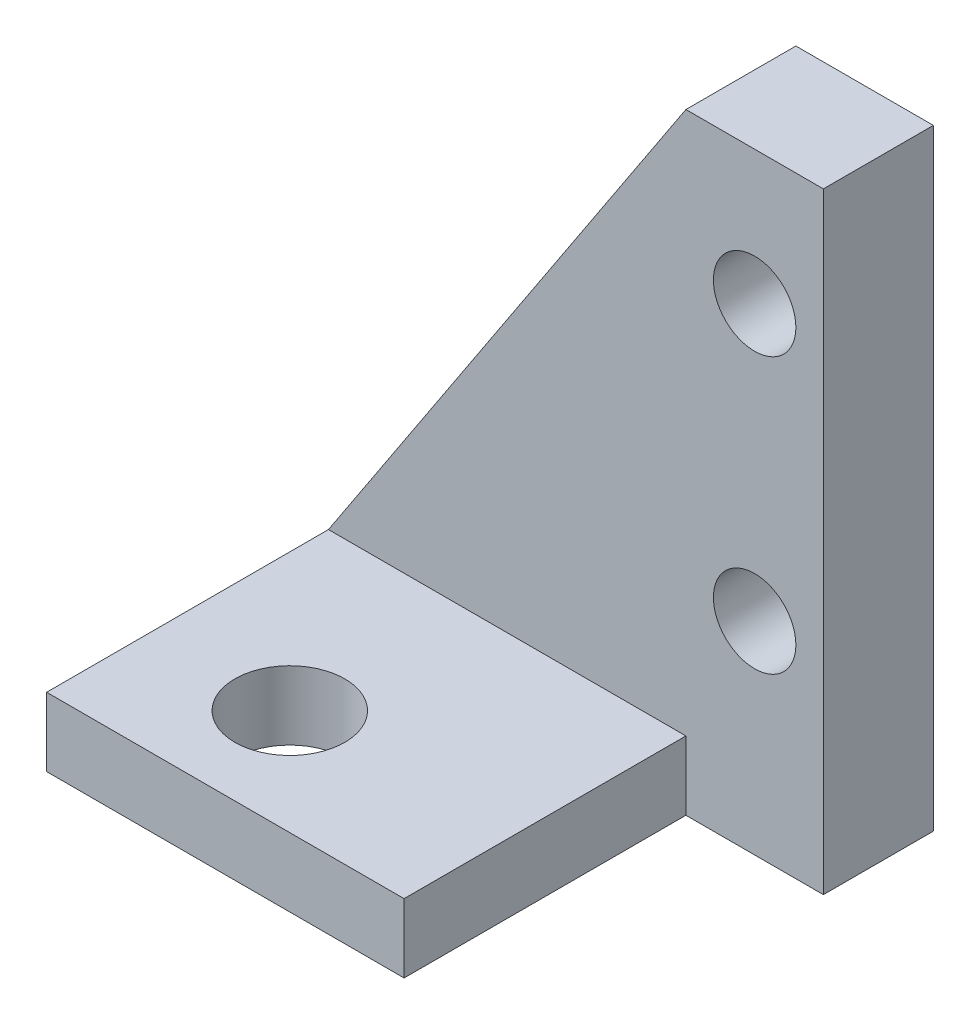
from build123d import *

# Parameters (mm, degrees)
SKETCH1_R            = 1.998719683
BOSS_EXTRUDE1_DEPTH  = 2.5
SKETCH5_W            = 10
SKETCH5_H            = 2.5
BOSS_EXTRUDE3_DEPTH  = 7.13
SKETCH6_W            = 10
SKETCH6_H            = 1.256651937
BOSS_EXTRUDE4_DEPTH  = 2.5
SKETCH8_W            = 5
SKETCH8_H            = 4
BOSS_EXTRUDE5_DEPTH  = 2.5
SKETCH9_W            = 5
SKETCH9_H            = 4
BOSS_EXTRUDE6_DEPTH  = 19.73
SKETCH12_R           = 1.5
CUT_EXTRUDE3_DEPTH   = 22
SKETCH13_W           = 3
SKETCH13_H           = 14.249346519
BOSS_EXTRUDE9_DEPTH  = 2.5
BOSS_EXTRUDE11_START = -2.5
SKETCH16_R           = 1.998719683
BOSS_EXTRUDE11_DEPTH = 2.5
SKETCH14_R           = 2
CUT_EXTRUDE5_DEPTH   = 2.5
BOSS_EXTRUDE12_DEPTH = 4


with BuildPart() as part:
    # Sketch1 → Boss-Extrude1 (new body)
    with BuildSketch(Plane(origin=(0, 0, 0), x_dir=(1, 0, 0), z_dir=(0, 1, 0))):
        Polygon((0, 4.586322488), (0, 0), (10, 0), (10, 5.862694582), (5, 5.862694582), (0, 5.862694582), align=None)
        with Locations(Location((5, 2.587602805, 0), (0, 0, 270))):
            Circle(SKETCH1_R, mode=Mode.SUBTRACT)
    extrude(amount=BOSS_EXTRUDE1_DEPTH)

    # Sketch5 → Boss-Extrude3 (add)
    with BuildSketch(Plane(origin=(0, 0, -5.862694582), x_dir=(-1, 0, 0), z_dir=(0, 0, -1))):
        with Locations((-5, 1.25)):
            Rectangle(SKETCH5_W, SKETCH5_H)
    extrude(amount=BOSS_EXTRUDE3_DEPTH)

    # Sketch6 → Boss-Extrude4 (add)
    with BuildSketch(Plane(origin=(0, 2.5, 0), x_dir=(1, 0, 0), z_dir=(0, 1, 0))):
        with Locations((5, -0.628325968)):
            Rectangle(SKETCH6_W, SKETCH6_H)
    extrude(amount=-BOSS_EXTRUDE4_DEPTH)

    # Sketch8 → Boss-Extrude5 (add)
    with BuildSketch(Plane(origin=(0, 2.5, 0), x_dir=(1, 0, 0), z_dir=(0, 1, 0))):
        with Locations((12.5, 10.992694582)):
            Rectangle(SKETCH8_W, SKETCH8_H)
    extrude(amount=-BOSS_EXTRUDE5_DEPTH)

    # Sketch9 → Boss-Extrude6 (add)
    with BuildSketch(Plane(origin=(0, 2.5, 0), x_dir=(-1, 0, 0), z_dir=(0, 1, 0))):
        with Locations((-12.5, -10.992694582)):
            Rectangle(SKETCH9_W, SKETCH9_H)
    extrude(amount=BOSS_EXTRUDE6_DEPTH)

    # Sketch12 → Cut-Extrude3 (cut)
    with BuildSketch(Plane.XY):
        with Locations((12.5, 17.365)):
            Circle(SKETCH12_R)
        with Locations((12.5, 7.365)):
            Circle(SKETCH12_R)
    extrude(amount=-CUT_EXTRUDE3_DEPTH, mode=Mode.SUBTRACT)

    # Sketch13 → Boss-Extrude9 (add)
    with BuildSketch(Plane(origin=(0, 2.5, 0), x_dir=(1, 0, 0), z_dir=(0, 1, 0))):
        with Locations((-1.5, 5.868021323)):
            Rectangle(SKETCH13_W, SKETCH13_H)
    extrude(amount=-BOSS_EXTRUDE9_DEPTH)

    # Sketch16 → Boss-Extrude11 (add)
    with BuildSketch(Plane(origin=(0, 2.5, 0), x_dir=(1, 0, 0), z_dir=(0, 1, 0)).offset(BOSS_EXTRUDE11_START)):
        with Locations((5, 2.587602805)):
            Circle(SKETCH16_R)
    extrude(amount=BOSS_EXTRUDE11_DEPTH)

    # Sketch14 → Cut-Extrude5 (cut)
    with BuildSketch(Plane(origin=(0, 2.5, 0), x_dir=(-1, 0, 0), z_dir=(0, 1, 0))):
        with Locations(Location((-2, -2.587602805, 0), (0, 0, 90))):
            Circle(SKETCH14_R)
    extrude(amount=-CUT_EXTRUDE5_DEPTH, mode=Mode.SUBTRACT)

    # Sketch15 → Boss-Extrude12 (add)
    with BuildSketch(Plane.XY.offset(-8.992694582)):
        Polygon((10, 22.23), (-3, 2.5), (10, 2.5), align=None)
    extrude(amount=-BOSS_EXTRUDE12_DEPTH)


solid = part.part
